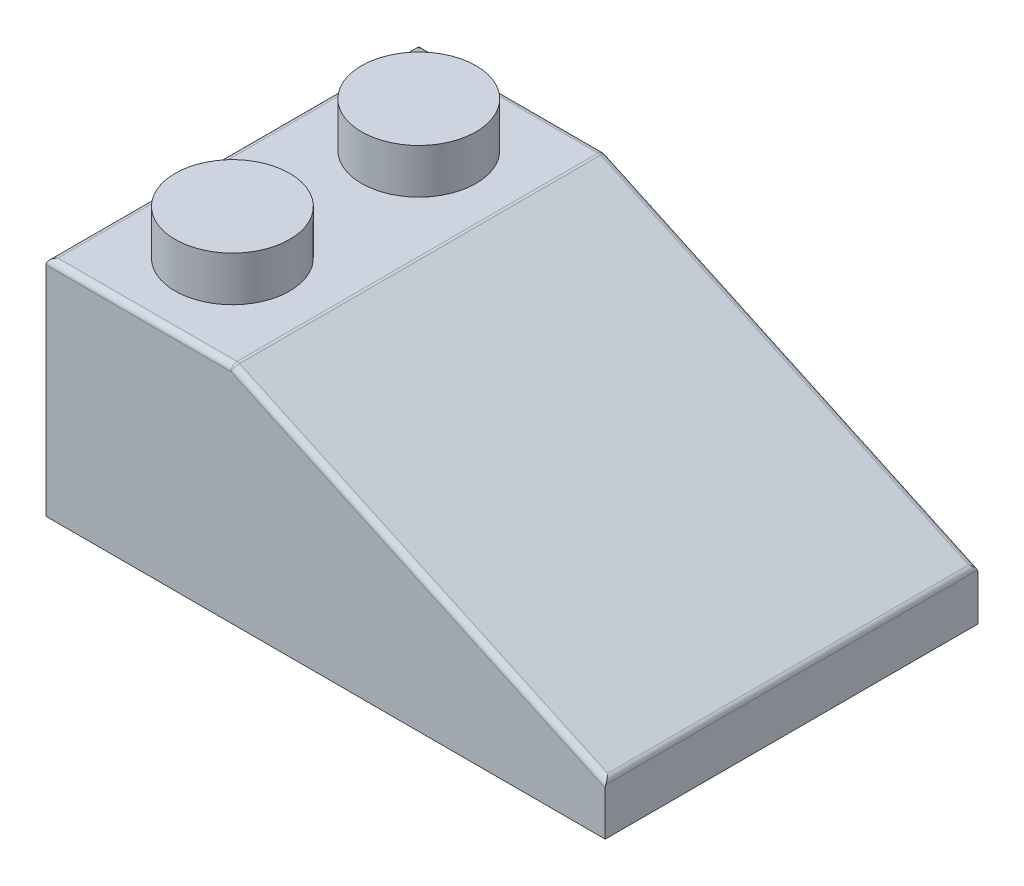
ISO-10303-21;
HEADER;
FILE_DESCRIPTION(('STEP AP214'),'2;1');
FILE_NAME('part.step','',(''),(''),'','','');
FILE_SCHEMA(('AUTOMOTIVE_DESIGN { 1 0 10303 214 1 1 1 1 }'));
ENDSEC;
DATA;
#1=APPLICATION_CONTEXT('core data for automotive mechanical design processes');
#2=APPLICATION_PROTOCOL_DEFINITION('international standard','automotive_design',2000,#1);
#3=PRODUCT_CONTEXT('',#1,'mechanical');
#4=PRODUCT('Part','Part','',(#3));
#5=PRODUCT_RELATED_PRODUCT_CATEGORY('part','',(#4));
#6=PRODUCT_DEFINITION_FORMATION('','',#4);
#7=PRODUCT_DEFINITION_CONTEXT('part definition',#1,'design');
#8=PRODUCT_DEFINITION('design','',#6,#7);
#9=PRODUCT_DEFINITION_SHAPE('','',#8);
#10=(LENGTH_UNIT() NAMED_UNIT(*) SI_UNIT(.MILLI.,.METRE.));
#11=(NAMED_UNIT(*) PLANE_ANGLE_UNIT() SI_UNIT($,.RADIAN.));
#12=(NAMED_UNIT(*) SI_UNIT($,.STERADIAN.) SOLID_ANGLE_UNIT());
#13=UNCERTAINTY_MEASURE_WITH_UNIT(LENGTH_MEASURE(1.E-05),#10,'distance_accuracy_value','');
#14=(GEOMETRIC_REPRESENTATION_CONTEXT(3) GLOBAL_UNCERTAINTY_ASSIGNED_CONTEXT((#13)) GLOBAL_UNIT_ASSIGNED_CONTEXT((#10,
#11,#12)) REPRESENTATION_CONTEXT('',''));
#15=CARTESIAN_POINT('',(0.,0.,0.));
#16=DIRECTION('',(0.,0.,1.));
#17=DIRECTION('',(1.,0.,0.));
#18=AXIS2_PLACEMENT_3D('',#15,#16,#17);
#19=CARTESIAN_POINT('',(-11.90625,0.,7.9375));
#20=DIRECTION('',(0.,-1.,0.));
#21=DIRECTION('',(0.,0.,-1.));
#22=AXIS2_PLACEMENT_3D('',#19,#20,#21);
#23=PLANE('',#22);
#24=DIRECTION('',(0.,0.,1.));
#25=VECTOR('',#24,1.);
#26=CARTESIAN_POINT('',(-11.90625,0.,-7.9375));
#27=LINE('',#26,#25);
#28=CARTESIAN_POINT('',(-11.90625,0.,-7.9375));
#29=VERTEX_POINT('',#28);
#30=CARTESIAN_POINT('',(-11.90625,0.,7.9375));
#31=VERTEX_POINT('',#30);
#32=EDGE_CURVE('E223',#29,#31,#27,.T.);
#33=ORIENTED_EDGE('',*,*,#32,.F.);
#34=DIRECTION('',(1.,0.,0.));
#35=VECTOR('',#34,1.);
#36=CARTESIAN_POINT('',(-11.90625,0.,-7.9375));
#37=LINE('',#36,#35);
#38=CARTESIAN_POINT('',(11.90625,0.,-7.9375));
#39=VERTEX_POINT('',#38);
#40=EDGE_CURVE('E232',#29,#39,#37,.T.);
#41=ORIENTED_EDGE('',*,*,#40,.T.);
#42=DIRECTION('',(0.,0.,-1.));
#43=VECTOR('',#42,1.);
#44=CARTESIAN_POINT('',(11.90625,0.,7.9375));
#45=LINE('',#44,#43);
#46=CARTESIAN_POINT('',(11.90625,0.,7.9375));
#47=VERTEX_POINT('',#46);
#48=EDGE_CURVE('E229',#47,#39,#45,.T.);
#49=ORIENTED_EDGE('',*,*,#48,.F.);
#50=DIRECTION('',(-1.,0.,0.));
#51=VECTOR('',#50,1.);
#52=CARTESIAN_POINT('',(11.90625,0.,7.9375));
#53=LINE('',#52,#51);
#54=EDGE_CURVE('E226',#47,#31,#53,.T.);
#55=ORIENTED_EDGE('',*,*,#54,.T.);
#56=EDGE_LOOP('',(#33,#41,#49,#55));
#57=FACE_BOUND('',#56,.T.);
#58=DIRECTION('',(1.,0.,0.));
#59=VECTOR('',#58,1.);
#60=CARTESIAN_POINT('',(-11.90625,0.,-6.35));
#61=LINE('',#60,#59);
#62=CARTESIAN_POINT('',(-10.31875,0.,-6.35));
#63=VERTEX_POINT('',#62);
#64=CARTESIAN_POINT('',(10.31875,0.,-6.35));
#65=VERTEX_POINT('',#64);
#66=EDGE_CURVE('E185',#63,#65,#61,.T.);
#67=ORIENTED_EDGE('',*,*,#66,.F.);
#68=DIRECTION('',(0.,0.,1.));
#69=VECTOR('',#68,1.);
#70=CARTESIAN_POINT('',(-10.31875,0.,7.9375));
#71=LINE('',#70,#69);
#72=CARTESIAN_POINT('',(-10.31875,0.,6.35));
#73=VERTEX_POINT('',#72);
#74=EDGE_CURVE('E207',#63,#73,#71,.T.);
#75=ORIENTED_EDGE('',*,*,#74,.T.);
#76=DIRECTION('',(-1.,0.,0.));
#77=VECTOR('',#76,1.);
#78=CARTESIAN_POINT('',(-11.90625,0.,6.35));
#79=LINE('',#78,#77);
#80=CARTESIAN_POINT('',(10.31875,0.,6.35));
#81=VERTEX_POINT('',#80);
#82=EDGE_CURVE('E213',#81,#73,#79,.T.);
#83=ORIENTED_EDGE('',*,*,#82,.F.);
#84=DIRECTION('',(0.,0.,-1.));
#85=VECTOR('',#84,1.);
#86=CARTESIAN_POINT('',(10.31875,0.,7.9375));
#87=LINE('',#86,#85);
#88=EDGE_CURVE('E216',#81,#65,#87,.T.);
#89=ORIENTED_EDGE('',*,*,#88,.T.);
#90=EDGE_LOOP('',(#67,#75,#83,#89));
#91=FACE_BOUND('',#90,.T.);
#92=ADVANCED_FACE('F38',(#57,#91),#23,.T.);
#93=CARTESIAN_POINT('',(-11.90625,9.525,7.9375));
#94=DIRECTION('',(0.,-1.,0.));
#95=DIRECTION('',(0.,0.,-1.));
#96=AXIS2_PLACEMENT_3D('',#93,#94,#95);
#97=PLANE('',#96);
#98=DIRECTION('',(1.,0.,0.));
#99=VECTOR('',#98,1.);
#100=CARTESIAN_POINT('',(-11.90625,9.525,-7.6835));
#101=LINE('',#100,#99);
#102=CARTESIAN_POINT('',(-4.02480771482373,9.525,-7.6835));
#103=VERTEX_POINT('',#102);
#104=CARTESIAN_POINT('',(-11.65225,9.525,-7.6835));
#105=VERTEX_POINT('',#104);
#106=EDGE_CURVE('E259',#103,#105,#101,.F.);
#107=ORIENTED_EDGE('',*,*,#106,.T.);
#108=DIRECTION('',(0.,0.,1.));
#109=VECTOR('',#108,1.);
#110=CARTESIAN_POINT('',(-11.65225,9.525,7.9375));
#111=LINE('',#110,#109);
#112=CARTESIAN_POINT('',(-11.65225,9.525,7.6835));
#113=VERTEX_POINT('',#112);
#114=EDGE_CURVE('E261',#105,#113,#111,.T.);
#115=ORIENTED_EDGE('',*,*,#114,.T.);
#116=DIRECTION('',(-1.,0.,0.));
#117=VECTOR('',#116,1.);
#118=CARTESIAN_POINT('',(-3.96875,9.525,7.6835));
#119=LINE('',#118,#117);
#120=CARTESIAN_POINT('',(-4.02480771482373,9.525,7.6835));
#121=VERTEX_POINT('',#120);
#122=EDGE_CURVE('E257',#113,#121,#119,.F.);
#123=ORIENTED_EDGE('',*,*,#122,.T.);
#124=DIRECTION('',(0.,0.,1.));
#125=VECTOR('',#124,1.);
#126=CARTESIAN_POINT('',(-4.02480771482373,9.525,7.9375));
#127=LINE('',#126,#125);
#128=EDGE_CURVE('E255',#121,#103,#127,.F.);
#129=ORIENTED_EDGE('',*,*,#128,.T.);
#130=EDGE_LOOP('',(#107,#115,#123,#129));
#131=FACE_BOUND('',#130,.T.);
#132=CARTESIAN_POINT('',(-7.9375,9.525,3.96875));
#133=DIRECTION('',(0.,-1.,0.));
#134=DIRECTION('',(0.,0.,-1.));
#135=AXIS2_PLACEMENT_3D('',#132,#133,#134);
#136=CIRCLE('',#135,2.4384);
#137=CARTESIAN_POINT('',(-7.9375,9.525,1.53035));
#138=VERTEX_POINT('',#137);
#139=EDGE_CURVE('E243',#138,#138,#136,.F.);
#140=ORIENTED_EDGE('',*,*,#139,.F.);
#141=EDGE_LOOP('',(#140));
#142=FACE_BOUND('',#141,.T.);
#143=CARTESIAN_POINT('',(-7.9375,9.525,-3.96875));
#144=DIRECTION('',(0.,-1.,0.));
#145=DIRECTION('',(0.,0.,-1.));
#146=AXIS2_PLACEMENT_3D('',#143,#144,#145);
#147=CIRCLE('',#146,2.4384);
#148=CARTESIAN_POINT('',(-7.9375,9.525,-6.40715));
#149=VERTEX_POINT('',#148);
#150=EDGE_CURVE('E246',#149,#149,#147,.F.);
#151=ORIENTED_EDGE('',*,*,#150,.F.);
#152=EDGE_LOOP('',(#151));
#153=FACE_BOUND('',#152,.T.);
#154=ADVANCED_FACE('F399',(#131,#142,#153),#97,.F.);
#155=CARTESIAN_POINT('',(-11.90625,9.525,-7.9375));
#156=DIRECTION('',(1.,0.,0.));
#157=DIRECTION('',(0.,0.,-1.));
#158=AXIS2_PLACEMENT_3D('',#155,#156,#157);
#159=PLANE('',#158);
#160=DIRECTION('',(0.,-1.,0.));
#161=VECTOR('',#160,1.);
#162=CARTESIAN_POINT('',(-11.90625,9.525,7.9375));
#163=LINE('',#162,#161);
#164=CARTESIAN_POINT('',(-11.90625,9.271,7.9375));
#165=VERTEX_POINT('',#164);
#166=EDGE_CURVE('E241',#165,#31,#163,.T.);
#167=ORIENTED_EDGE('',*,*,#166,.F.);
#168=DIRECTION('',(0.,0.,1.));
#169=VECTOR('',#168,1.);
#170=CARTESIAN_POINT('',(-11.90625,9.271,-7.9375));
#171=LINE('',#170,#169);
#172=CARTESIAN_POINT('',(-11.90625,9.271,-7.9375));
#173=VERTEX_POINT('',#172);
#174=EDGE_CURVE('E264',#165,#173,#171,.F.);
#175=ORIENTED_EDGE('',*,*,#174,.T.);
#176=DIRECTION('',(0.,-1.,0.));
#177=VECTOR('',#176,1.);
#178=CARTESIAN_POINT('',(-11.90625,9.525,-7.9375));
#179=LINE('',#178,#177);
#180=EDGE_CURVE('E235',#173,#29,#179,.T.);
#181=ORIENTED_EDGE('',*,*,#180,.T.);
#182=ORIENTED_EDGE('',*,*,#32,.T.);
#183=EDGE_LOOP('',(#167,#175,#181,#182));
#184=FACE_BOUND('',#183,.T.);
#185=ADVANCED_FACE('F320',(#184),#159,.F.);
#186=CARTESIAN_POINT('',(11.90625,9.525,7.9375));
#187=DIRECTION('',(0.,0.,1.));
#188=DIRECTION('',(1.,0.,0.));
#189=AXIS2_PLACEMENT_3D('',#186,#187,#188);
#190=PLANE('',#189);
#191=DIRECTION('',(0.907107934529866,-0.420898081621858,0.));
#192=VECTOR('',#191,1.);
#193=CARTESIAN_POINT('',(-4.07565811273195,9.29459458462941,7.9375));
#194=LINE('',#193,#192);
#195=CARTESIAN_POINT('',(11.90625,1.87898922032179,7.9375));
#196=VERTEX_POINT('',#195);
#197=CARTESIAN_POINT('',(-4.02480771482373,9.271,7.9375));
#198=VERTEX_POINT('',#197);
#199=EDGE_CURVE('E271',#196,#198,#194,.F.);
#200=ORIENTED_EDGE('',*,*,#199,.T.);
#201=DIRECTION('',(-1.,0.,0.));
#202=VECTOR('',#201,1.);
#203=CARTESIAN_POINT('',(-11.90625,9.271,7.9375));
#204=LINE('',#203,#202);
#205=EDGE_CURVE('E273',#198,#165,#204,.T.);
#206=ORIENTED_EDGE('',*,*,#205,.T.);
#207=ORIENTED_EDGE('',*,*,#166,.T.);
#208=ORIENTED_EDGE('',*,*,#54,.F.);
#209=DIRECTION('',(0.,-1.,0.));
#210=VECTOR('',#209,1.);
#211=CARTESIAN_POINT('',(11.90625,9.525,7.9375));
#212=LINE('',#211,#210);
#213=EDGE_CURVE('E239',#196,#47,#212,.T.);
#214=ORIENTED_EDGE('',*,*,#213,.F.);
#215=EDGE_LOOP('',(#200,#206,#207,#208,#214));
#216=FACE_BOUND('',#215,.T.);
#217=ADVANCED_FACE('F294',(#216),#190,.T.);
#218=CARTESIAN_POINT('',(11.90625,9.525,7.9375));
#219=DIRECTION('',(-1.,0.,0.));
#220=DIRECTION('',(0.,0.,1.));
#221=AXIS2_PLACEMENT_3D('',#218,#219,#220);
#222=PLANE('',#221);
#223=DIRECTION('',(0.,-1.,0.));
#224=VECTOR('',#223,1.);
#225=CARTESIAN_POINT('',(11.90625,9.525,-7.9375));
#226=LINE('',#225,#224);
#227=CARTESIAN_POINT('',(11.90625,1.87898922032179,-7.9375));
#228=VERTEX_POINT('',#227);
#229=EDGE_CURVE('E237',#228,#39,#226,.T.);
#230=ORIENTED_EDGE('',*,*,#229,.F.);
#231=CARTESIAN_POINT('',(11.90625,1.87898922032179,-7.6835));
#232=DIRECTION('',(-1.,0.,0.));
#233=DIRECTION('',(0.,1.,0.));
#234=AXIS2_PLACEMENT_3D('',#231,#232,#233);
#235=ELLIPSE('',#234,0.280010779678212,0.254);
#236=CARTESIAN_POINT('',(11.90625,1.99684522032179,-7.91390541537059));
#237=VERTEX_POINT('',#236);
#238=EDGE_CURVE('E11',#228,#237,#235,.F.);
#239=ORIENTED_EDGE('',*,*,#238,.T.);
#240=DIRECTION('',(0.,0.,1.));
#241=VECTOR('',#240,1.);
#242=CARTESIAN_POINT('',(11.90625,1.99684522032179,7.9375));
#243=LINE('',#242,#241);
#244=CARTESIAN_POINT('',(11.90625,1.99684522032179,7.91390541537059));
#245=VERTEX_POINT('',#244);
#246=EDGE_CURVE('E46',#237,#245,#243,.T.);
#247=ORIENTED_EDGE('',*,*,#246,.T.);
#248=CARTESIAN_POINT('',(11.90625,1.87898922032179,7.6835));
#249=DIRECTION('',(-1.,0.,0.));
#250=DIRECTION('',(0.,1.,0.));
#251=AXIS2_PLACEMENT_3D('',#248,#249,#250);
#252=ELLIPSE('',#251,0.280010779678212,0.254);
#253=EDGE_CURVE('E284',#245,#196,#252,.F.);
#254=ORIENTED_EDGE('',*,*,#253,.T.);
#255=ORIENTED_EDGE('',*,*,#213,.T.);
#256=ORIENTED_EDGE('',*,*,#48,.T.);
#257=EDGE_LOOP('',(#230,#239,#247,#254,#255,#256));
#258=FACE_BOUND('',#257,.T.);
#259=ADVANCED_FACE('F287',(#258),#222,.F.);
#260=CARTESIAN_POINT('',(-11.90625,9.525,-7.9375));
#261=DIRECTION('',(0.,0.,-1.));
#262=DIRECTION('',(-1.,0.,0.));
#263=AXIS2_PLACEMENT_3D('',#260,#261,#262);
#264=PLANE('',#263);
#265=ORIENTED_EDGE('',*,*,#180,.F.);
#266=DIRECTION('',(1.,0.,0.));
#267=VECTOR('',#266,1.);
#268=CARTESIAN_POINT('',(-3.96875,9.271,-7.9375));
#269=LINE('',#268,#267);
#270=CARTESIAN_POINT('',(-4.02480771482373,9.271,-7.9375));
#271=VERTEX_POINT('',#270);
#272=EDGE_CURVE('E269',#173,#271,#269,.T.);
#273=ORIENTED_EDGE('',*,*,#272,.T.);
#274=DIRECTION('',(0.907107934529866,-0.420898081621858,0.));
#275=VECTOR('',#274,1.);
#276=CARTESIAN_POINT('',(11.7993418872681,1.92859458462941,-7.9375));
#277=LINE('',#276,#275);
#278=EDGE_CURVE('E267',#271,#228,#277,.T.);
#279=ORIENTED_EDGE('',*,*,#278,.T.);
#280=ORIENTED_EDGE('',*,*,#229,.T.);
#281=ORIENTED_EDGE('',*,*,#40,.F.);
#282=EDGE_LOOP('',(#265,#273,#279,#280,#281));
#283=FACE_BOUND('',#282,.T.);
#284=ADVANCED_FACE('F336',(#283),#264,.T.);
#285=CARTESIAN_POINT('',(-7.9375,11.43,3.96875));
#286=DIRECTION('',(0.,-1.,0.));
#287=DIRECTION('',(0.,0.,-1.));
#288=AXIS2_PLACEMENT_3D('',#285,#286,#287);
#289=CYLINDRICAL_SURFACE('',#288,2.4384);
#290=CARTESIAN_POINT('',(-7.9375,11.43,3.96875));
#291=DIRECTION('',(0.,1.,0.));
#292=DIRECTION('',(0.,0.,1.));
#293=AXIS2_PLACEMENT_3D('',#290,#291,#292);
#294=CIRCLE('',#293,2.4384);
#295=CARTESIAN_POINT('',(-7.9375,11.43,1.53035));
#296=VERTEX_POINT('',#295);
#297=EDGE_CURVE('E210',#296,#296,#294,.T.);
#298=CARTESIAN_POINT('',(-7.9375,11.43,1.53035));
#299=CARTESIAN_POINT('',(-7.9375,11.41015625,1.53035));
#300=CARTESIAN_POINT('',(-7.9375,11.3903125,1.53035));
#301=CARTESIAN_POINT('',(-7.9375,11.350625,1.53035));
#302=CARTESIAN_POINT('',(-7.9375,11.33078125,1.53035));
#303=CARTESIAN_POINT('',(-7.9375,11.29109375,1.53035));
#304=CARTESIAN_POINT('',(-7.9375,11.27125,1.53035));
#305=CARTESIAN_POINT('',(-7.9375,11.2315625,1.53035));
#306=CARTESIAN_POINT('',(-7.9375,11.21171875,1.53035));
#307=CARTESIAN_POINT('',(-7.9375,11.17203125,1.53035));
#308=CARTESIAN_POINT('',(-7.9375,11.1521875,1.53035));
#309=CARTESIAN_POINT('',(-7.9375,11.1125,1.53035));
#310=CARTESIAN_POINT('',(-7.9375,11.09265625,1.53035));
#311=CARTESIAN_POINT('',(-7.9375,11.05296875,1.53035));
#312=CARTESIAN_POINT('',(-7.9375,11.033125,1.53035));
#313=CARTESIAN_POINT('',(-7.9375,10.9934375,1.53035));
#314=CARTESIAN_POINT('',(-7.9375,10.97359375,1.53035));
#315=CARTESIAN_POINT('',(-7.9375,10.93390625,1.53035));
#316=CARTESIAN_POINT('',(-7.9375,10.9140625,1.53035));
#317=CARTESIAN_POINT('',(-7.9375,10.874375,1.53035));
#318=CARTESIAN_POINT('',(-7.9375,10.85453125,1.53035));
#319=CARTESIAN_POINT('',(-7.9375,10.81484375,1.53035));
#320=CARTESIAN_POINT('',(-7.9375,10.795,1.53035));
#321=CARTESIAN_POINT('',(-7.9375,10.7553125,1.53035));
#322=CARTESIAN_POINT('',(-7.9375,10.73546875,1.53035));
#323=CARTESIAN_POINT('',(-7.9375,10.69578125,1.53035));
#324=CARTESIAN_POINT('',(-7.9375,10.6759375,1.53035));
#325=CARTESIAN_POINT('',(-7.9375,10.63625,1.53035));
#326=CARTESIAN_POINT('',(-7.9375,10.61640625,1.53035));
#327=CARTESIAN_POINT('',(-7.9375,10.57671875,1.53035));
#328=CARTESIAN_POINT('',(-7.9375,10.556875,1.53035));
#329=CARTESIAN_POINT('',(-7.9375,10.5171875,1.53035));
#330=CARTESIAN_POINT('',(-7.9375,10.49734375,1.53035));
#331=CARTESIAN_POINT('',(-7.9375,10.45765625,1.53035));
#332=CARTESIAN_POINT('',(-7.9375,10.4378125,1.53035));
#333=CARTESIAN_POINT('',(-7.9375,10.398125,1.53035));
#334=CARTESIAN_POINT('',(-7.9375,10.37828125,1.53035));
#335=CARTESIAN_POINT('',(-7.9375,10.33859375,1.53035));
#336=CARTESIAN_POINT('',(-7.9375,10.31875,1.53035));
#337=CARTESIAN_POINT('',(-7.9375,10.2790625,1.53035));
#338=CARTESIAN_POINT('',(-7.9375,10.25921875,1.53035));
#339=CARTESIAN_POINT('',(-7.9375,10.21953125,1.53035));
#340=CARTESIAN_POINT('',(-7.9375,10.1996875,1.53035));
#341=CARTESIAN_POINT('',(-7.9375,10.16,1.53035));
#342=CARTESIAN_POINT('',(-7.9375,10.14015625,1.53035));
#343=CARTESIAN_POINT('',(-7.9375,10.10046875,1.53035));
#344=CARTESIAN_POINT('',(-7.9375,10.080625,1.53035));
#345=CARTESIAN_POINT('',(-7.9375,10.0409375,1.53035));
#346=CARTESIAN_POINT('',(-7.9375,10.02109375,1.53035));
#347=CARTESIAN_POINT('',(-7.9375,9.98140625,1.53035));
#348=CARTESIAN_POINT('',(-7.9375,9.9615625,1.53035));
#349=CARTESIAN_POINT('',(-7.9375,9.921875,1.53035));
#350=CARTESIAN_POINT('',(-7.9375,9.90203125,1.53035));
#351=CARTESIAN_POINT('',(-7.9375,9.86234375,1.53035));
#352=CARTESIAN_POINT('',(-7.9375,9.8425,1.53035));
#353=CARTESIAN_POINT('',(-7.9375,9.8028125,1.53035));
#354=CARTESIAN_POINT('',(-7.9375,9.78296875,1.53035));
#355=CARTESIAN_POINT('',(-7.9375,9.74328125,1.53035));
#356=CARTESIAN_POINT('',(-7.9375,9.7234375,1.53035));
#357=CARTESIAN_POINT('',(-7.9375,9.68375,1.53035));
#358=CARTESIAN_POINT('',(-7.9375,9.66390625,1.53035));
#359=CARTESIAN_POINT('',(-7.9375,9.62421875,1.53035));
#360=CARTESIAN_POINT('',(-7.9375,9.604375,1.53035));
#361=CARTESIAN_POINT('',(-7.9375,9.5646875,1.53035));
#362=CARTESIAN_POINT('',(-7.9375,9.54484375,1.53035));
#363=CARTESIAN_POINT('',(-7.9375,9.525,1.53035));
#364=B_SPLINE_CURVE_WITH_KNOTS('',3,(#298,#299,#300,#301,#302,#303,#304,#305,#306,#307,#308,
#309,#310,#311,#312,#313,#314,#315,#316,#317,#318,#319,#320,#321,#322,#323,#324,#325,#326,#327,
#328,#329,#330,#331,#332,#333,#334,#335,#336,#337,#338,#339,#340,#341,#342,#343,#344,#345,#346,
#347,#348,#349,#350,#351,#352,#353,#354,#355,#356,#357,#358,#359,#360,#361,#362,#363),
.UNSPECIFIED.,.F.,.F.,(4,2,2,2,2,2,2,2,2,2,2,2,2,2,2,2,2,2,2,2,2,2,2,2,2,2,2,2,2,2,2,2,4),(0.,
0.0595312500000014,0.119062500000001,0.178593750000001,0.238125,0.29765625,0.3571875,
0.416718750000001,0.476250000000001,0.535781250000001,0.5953125,0.65484375,0.714375,
0.773906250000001,0.833437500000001,0.892968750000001,0.9525,1.01203125,1.0715625,1.13109375,
1.190625,1.25015625,1.3096875,1.36921875,1.42875,1.48828125,1.5478125,1.60734375,1.666875,
1.72640625,1.7859375,1.84546875,1.905),.UNSPECIFIED.);
#365=EDGE_CURVE('BSEAM409',#296,#138,#364,.T.);
#366=ORIENTED_EDGE('',*,*,#297,.F.);
#367=ORIENTED_EDGE('',*,*,#139,.T.);
#368=ORIENTED_EDGE('',*,*,#365,.T.);
#369=ORIENTED_EDGE('',*,*,#365,.F.);
#370=EDGE_LOOP('',(#366,#368,#367,#369));
#371=FACE_BOUND('',#370,.T.);
#372=ADVANCED_FACE('F409',(#371),#289,.T.);
#373=CARTESIAN_POINT('',(-7.9375,11.43,3.96875));
#374=DIRECTION('',(0.,1.,0.));
#375=DIRECTION('',(0.,0.,1.));
#376=AXIS2_PLACEMENT_3D('',#373,#374,#375);
#377=PLANE('',#376);
#378=ORIENTED_EDGE('',*,*,#297,.T.);
#379=EDGE_LOOP('',(#378));
#380=FACE_BOUND('',#379,.T.);
#381=ADVANCED_FACE('F429',(#380),#377,.T.);
#382=CARTESIAN_POINT('',(-7.9375,11.43,-3.96875));
#383=DIRECTION('',(0.,1.,0.));
#384=DIRECTION('',(0.,0.,1.));
#385=AXIS2_PLACEMENT_3D('',#382,#383,#384);
#386=PLANE('',#385);
#387=CARTESIAN_POINT('',(-7.9375,11.43,-3.96875));
#388=DIRECTION('',(0.,1.,0.));
#389=DIRECTION('',(0.,0.,1.));
#390=AXIS2_PLACEMENT_3D('',#387,#388,#389);
#391=CIRCLE('',#390,2.4384);
#392=CARTESIAN_POINT('',(-7.9375,11.43,-6.40715));
#393=VERTEX_POINT('',#392);
#394=EDGE_CURVE('E249',#393,#393,#391,.T.);
#395=ORIENTED_EDGE('',*,*,#394,.T.);
#396=EDGE_LOOP('',(#395));
#397=FACE_BOUND('',#396,.T.);
#398=ADVANCED_FACE('F40',(#397),#386,.T.);
#399=CARTESIAN_POINT('',(-7.9375,11.43,-3.96875));
#400=DIRECTION('',(0.,-1.,0.));
#401=DIRECTION('',(0.,0.,-1.));
#402=AXIS2_PLACEMENT_3D('',#399,#400,#401);
#403=CYLINDRICAL_SURFACE('',#402,2.4384);
#404=CARTESIAN_POINT('',(-7.9375,11.43,-6.40715));
#405=CARTESIAN_POINT('',(-7.9375,11.41015625,-6.40715));
#406=CARTESIAN_POINT('',(-7.9375,11.3903125,-6.40715));
#407=CARTESIAN_POINT('',(-7.9375,11.350625,-6.40715));
#408=CARTESIAN_POINT('',(-7.9375,11.33078125,-6.40715));
#409=CARTESIAN_POINT('',(-7.9375,11.29109375,-6.40715));
#410=CARTESIAN_POINT('',(-7.9375,11.27125,-6.40715));
#411=CARTESIAN_POINT('',(-7.9375,11.2315625,-6.40715));
#412=CARTESIAN_POINT('',(-7.9375,11.21171875,-6.40715));
#413=CARTESIAN_POINT('',(-7.9375,11.17203125,-6.40715));
#414=CARTESIAN_POINT('',(-7.9375,11.1521875,-6.40715));
#415=CARTESIAN_POINT('',(-7.9375,11.1125,-6.40715));
#416=CARTESIAN_POINT('',(-7.9375,11.09265625,-6.40715));
#417=CARTESIAN_POINT('',(-7.9375,11.05296875,-6.40715));
#418=CARTESIAN_POINT('',(-7.9375,11.033125,-6.40715));
#419=CARTESIAN_POINT('',(-7.9375,10.9934375,-6.40715));
#420=CARTESIAN_POINT('',(-7.9375,10.97359375,-6.40715));
#421=CARTESIAN_POINT('',(-7.9375,10.93390625,-6.40715));
#422=CARTESIAN_POINT('',(-7.9375,10.9140625,-6.40715));
#423=CARTESIAN_POINT('',(-7.9375,10.874375,-6.40715));
#424=CARTESIAN_POINT('',(-7.9375,10.85453125,-6.40715));
#425=CARTESIAN_POINT('',(-7.9375,10.81484375,-6.40715));
#426=CARTESIAN_POINT('',(-7.9375,10.795,-6.40715));
#427=CARTESIAN_POINT('',(-7.9375,10.7553125,-6.40715));
#428=CARTESIAN_POINT('',(-7.9375,10.73546875,-6.40715));
#429=CARTESIAN_POINT('',(-7.9375,10.69578125,-6.40715));
#430=CARTESIAN_POINT('',(-7.9375,10.6759375,-6.40715));
#431=CARTESIAN_POINT('',(-7.9375,10.63625,-6.40715));
#432=CARTESIAN_POINT('',(-7.9375,10.61640625,-6.40715));
#433=CARTESIAN_POINT('',(-7.9375,10.57671875,-6.40715));
#434=CARTESIAN_POINT('',(-7.9375,10.556875,-6.40715));
#435=CARTESIAN_POINT('',(-7.9375,10.5171875,-6.40715));
#436=CARTESIAN_POINT('',(-7.9375,10.49734375,-6.40715));
#437=CARTESIAN_POINT('',(-7.9375,10.45765625,-6.40715));
#438=CARTESIAN_POINT('',(-7.9375,10.4378125,-6.40715));
#439=CARTESIAN_POINT('',(-7.9375,10.398125,-6.40715));
#440=CARTESIAN_POINT('',(-7.9375,10.37828125,-6.40715));
#441=CARTESIAN_POINT('',(-7.9375,10.33859375,-6.40715));
#442=CARTESIAN_POINT('',(-7.9375,10.31875,-6.40715));
#443=CARTESIAN_POINT('',(-7.9375,10.2790625,-6.40715));
#444=CARTESIAN_POINT('',(-7.9375,10.25921875,-6.40715));
#445=CARTESIAN_POINT('',(-7.9375,10.21953125,-6.40715));
#446=CARTESIAN_POINT('',(-7.9375,10.1996875,-6.40715));
#447=CARTESIAN_POINT('',(-7.9375,10.16,-6.40715));
#448=CARTESIAN_POINT('',(-7.9375,10.14015625,-6.40715));
#449=CARTESIAN_POINT('',(-7.9375,10.10046875,-6.40715));
#450=CARTESIAN_POINT('',(-7.9375,10.080625,-6.40715));
#451=CARTESIAN_POINT('',(-7.9375,10.0409375,-6.40715));
#452=CARTESIAN_POINT('',(-7.9375,10.02109375,-6.40715));
#453=CARTESIAN_POINT('',(-7.9375,9.98140625,-6.40715));
#454=CARTESIAN_POINT('',(-7.9375,9.9615625,-6.40715));
#455=CARTESIAN_POINT('',(-7.9375,9.921875,-6.40715));
#456=CARTESIAN_POINT('',(-7.9375,9.90203125,-6.40715));
#457=CARTESIAN_POINT('',(-7.9375,9.86234375,-6.40715));
#458=CARTESIAN_POINT('',(-7.9375,9.8425,-6.40715));
#459=CARTESIAN_POINT('',(-7.9375,9.8028125,-6.40715));
#460=CARTESIAN_POINT('',(-7.9375,9.78296875,-6.40715));
#461=CARTESIAN_POINT('',(-7.9375,9.74328125,-6.40715));
#462=CARTESIAN_POINT('',(-7.9375,9.7234375,-6.40715));
#463=CARTESIAN_POINT('',(-7.9375,9.68375,-6.40715));
#464=CARTESIAN_POINT('',(-7.9375,9.66390625,-6.40715));
#465=CARTESIAN_POINT('',(-7.9375,9.62421875,-6.40715));
#466=CARTESIAN_POINT('',(-7.9375,9.604375,-6.40715));
#467=CARTESIAN_POINT('',(-7.9375,9.5646875,-6.40715));
#468=CARTESIAN_POINT('',(-7.9375,9.54484375,-6.40715));
#469=CARTESIAN_POINT('',(-7.9375,9.525,-6.40715));
#470=B_SPLINE_CURVE_WITH_KNOTS('',3,(#404,#405,#406,#407,#408,#409,#410,#411,#412,#413,#414,
#415,#416,#417,#418,#419,#420,#421,#422,#423,#424,#425,#426,#427,#428,#429,#430,#431,#432,#433,
#434,#435,#436,#437,#438,#439,#440,#441,#442,#443,#444,#445,#446,#447,#448,#449,#450,#451,#452,
#453,#454,#455,#456,#457,#458,#459,#460,#461,#462,#463,#464,#465,#466,#467,#468,#469),
.UNSPECIFIED.,.F.,.F.,(4,2,2,2,2,2,2,2,2,2,2,2,2,2,2,2,2,2,2,2,2,2,2,2,2,2,2,2,2,2,2,2,4),(0.,
0.0595312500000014,0.119062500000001,0.178593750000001,0.238125,0.29765625,0.3571875,
0.416718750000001,0.476250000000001,0.535781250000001,0.5953125,0.65484375,0.714375,
0.773906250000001,0.833437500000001,0.892968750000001,0.9525,1.01203125,1.0715625,1.13109375,
1.190625,1.25015625,1.3096875,1.36921875,1.42875,1.48828125,1.5478125,1.60734375,1.666875,
1.72640625,1.7859375,1.84546875,1.905),.UNSPECIFIED.);
#471=EDGE_CURVE('BSEAM419',#393,#149,#470,.T.);
#472=ORIENTED_EDGE('',*,*,#394,.F.);
#473=ORIENTED_EDGE('',*,*,#150,.T.);
#474=ORIENTED_EDGE('',*,*,#471,.T.);
#475=ORIENTED_EDGE('',*,*,#471,.F.);
#476=EDGE_LOOP('',(#472,#474,#473,#475));
#477=FACE_BOUND('',#476,.T.);
#478=ADVANCED_FACE('F419',(#477),#403,.T.);
#479=CARTESIAN_POINT('',(-3.96875,9.525,-7.9375));
#480=DIRECTION('',(-0.420898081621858,-0.907107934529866,0.));
#481=DIRECTION('',(0.907107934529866,-0.420898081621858,0.));
#482=AXIS2_PLACEMENT_3D('',#479,#480,#481);
#483=PLANE('',#482);
#484=DIRECTION('',(0.907107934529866,-0.420898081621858,0.));
#485=VECTOR('',#484,1.);
#486=CARTESIAN_POINT('',(-3.96875,9.525,-7.6835));
#487=LINE('',#486,#485);
#488=CARTESIAN_POINT('',(11.759158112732,2.22725063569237,-7.6835));
#489=VERTEX_POINT('',#488);
#490=CARTESIAN_POINT('',(-3.91789960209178,9.50140541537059,-7.6835));
#491=VERTEX_POINT('',#490);
#492=EDGE_CURVE('E279',#489,#491,#487,.F.);
#493=ORIENTED_EDGE('',*,*,#492,.T.);
#494=DIRECTION('',(0.,0.,1.));
#495=VECTOR('',#494,1.);
#496=CARTESIAN_POINT('',(-3.91789960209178,9.50140541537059,-7.9375));
#497=LINE('',#496,#495);
#498=CARTESIAN_POINT('',(-3.91789960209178,9.50140541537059,7.6835));
#499=VERTEX_POINT('',#498);
#500=EDGE_CURVE('E281',#491,#499,#497,.T.);
#501=ORIENTED_EDGE('',*,*,#500,.T.);
#502=DIRECTION('',(0.907107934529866,-0.420898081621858,0.));
#503=VECTOR('',#502,1.);
#504=CARTESIAN_POINT('',(11.90625,2.159,7.6835));
#505=LINE('',#504,#503);
#506=CARTESIAN_POINT('',(11.759158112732,2.22725063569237,7.6835));
#507=VERTEX_POINT('',#506);
#508=EDGE_CURVE('E275',#499,#507,#505,.T.);
#509=ORIENTED_EDGE('',*,*,#508,.T.);
#510=DIRECTION('',(0.,0.,1.));
#511=VECTOR('',#510,1.);
#512=CARTESIAN_POINT('',(11.7591581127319,2.22725063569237,-7.9375));
#513=LINE('',#512,#511);
#514=EDGE_CURVE('E277',#507,#489,#513,.F.);
#515=ORIENTED_EDGE('',*,*,#514,.T.);
#516=EDGE_LOOP('',(#493,#501,#509,#515));
#517=FACE_BOUND('',#516,.T.);
#518=ADVANCED_FACE('F421',(#517),#483,.F.);
#519=CARTESIAN_POINT('',(-11.90625,7.9375,7.9375));
#520=DIRECTION('',(0.,-1.,0.));
#521=DIRECTION('',(0.,0.,-1.));
#522=AXIS2_PLACEMENT_3D('',#519,#520,#521);
#523=PLANE('',#522);
#524=CARTESIAN_POINT('',(-3.96875,7.9375,0.));
#525=DIRECTION('',(0.,-1.,0.));
#526=DIRECTION('',(0.,0.,-1.));
#527=AXIS2_PLACEMENT_3D('',#524,#525,#526);
#528=CIRCLE('',#527,3.2004);
#529=CARTESIAN_POINT('',(-4.31911071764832,7.9375,-3.18116449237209));
#530=VERTEX_POINT('',#529);
#531=CARTESIAN_POINT('',(-4.31911071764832,7.9375,3.18116449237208));
#532=VERTEX_POINT('',#531);
#533=EDGE_CURVE('E369',#530,#532,#528,.F.);
#534=ORIENTED_EDGE('',*,*,#533,.T.);
#535=DIRECTION('',(0.,0.,1.));
#536=VECTOR('',#535,1.);
#537=CARTESIAN_POINT('',(-4.31911071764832,7.9375,-7.9375));
#538=LINE('',#537,#536);
#539=CARTESIAN_POINT('',(-4.31911071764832,7.9375,6.35));
#540=VERTEX_POINT('',#539);
#541=EDGE_CURVE('E169',#532,#540,#538,.T.);
#542=ORIENTED_EDGE('',*,*,#541,.T.);
#543=DIRECTION('',(-1.,0.,0.));
#544=VECTOR('',#543,1.);
#545=CARTESIAN_POINT('',(-11.90625,7.9375,6.35));
#546=LINE('',#545,#544);
#547=CARTESIAN_POINT('',(-10.31875,7.9375,6.35));
#548=VERTEX_POINT('',#547);
#549=EDGE_CURVE('E176',#540,#548,#546,.T.);
#550=ORIENTED_EDGE('',*,*,#549,.T.);
#551=DIRECTION('',(0.,0.,1.));
#552=VECTOR('',#551,1.);
#553=CARTESIAN_POINT('',(-10.31875,7.9375,7.9375));
#554=LINE('',#553,#552);
#555=CARTESIAN_POINT('',(-10.31875,7.9375,-6.35));
#556=VERTEX_POINT('',#555);
#557=EDGE_CURVE('E182',#556,#548,#554,.T.);
#558=ORIENTED_EDGE('',*,*,#557,.F.);
#559=DIRECTION('',(1.,0.,0.));
#560=VECTOR('',#559,1.);
#561=CARTESIAN_POINT('',(-11.90625,7.9375,-6.35));
#562=LINE('',#561,#560);
#563=CARTESIAN_POINT('',(-4.31911071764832,7.9375,-6.35));
#564=VERTEX_POINT('',#563);
#565=EDGE_CURVE('E178',#556,#564,#562,.T.);
#566=ORIENTED_EDGE('',*,*,#565,.T.);
#567=EDGE_CURVE('E168',#564,#530,#538,.T.);
#568=ORIENTED_EDGE('',*,*,#567,.T.);
#569=EDGE_LOOP('',(#534,#542,#550,#558,#566,#568));
#570=FACE_BOUND('',#569,.T.);
#571=CARTESIAN_POINT('',(-7.9375,7.9375,3.96875));
#572=DIRECTION('',(0.,-1.,0.));
#573=DIRECTION('',(0.,0.,-1.));
#574=AXIS2_PLACEMENT_3D('',#571,#572,#573);
#575=CIRCLE('',#574,0.850899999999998);
#576=CARTESIAN_POINT('',(-7.9375,7.9375,3.11785));
#577=VERTEX_POINT('',#576);
#578=EDGE_CURVE('E190',#577,#577,#575,.F.);
#579=ORIENTED_EDGE('',*,*,#578,.T.);
#580=EDGE_LOOP('',(#579));
#581=FACE_BOUND('',#580,.T.);
#582=CARTESIAN_POINT('',(-7.9375,7.9375,-3.96875));
#583=DIRECTION('',(0.,-1.,0.));
#584=DIRECTION('',(0.,0.,-1.));
#585=AXIS2_PLACEMENT_3D('',#582,#583,#584);
#586=CIRCLE('',#585,0.850899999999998);
#587=CARTESIAN_POINT('',(-7.9375,7.9375,-4.81965));
#588=VERTEX_POINT('',#587);
#589=EDGE_CURVE('E186',#588,#588,#586,.F.);
#590=ORIENTED_EDGE('',*,*,#589,.T.);
#591=EDGE_LOOP('',(#590));
#592=FACE_BOUND('',#591,.T.);
#593=ADVANCED_FACE('F379',(#570,#581,#592),#523,.T.);
#594=CARTESIAN_POINT('',(-10.31875,9.525,-7.9375));
#595=DIRECTION('',(1.,0.,0.));
#596=DIRECTION('',(0.,0.,-1.));
#597=AXIS2_PLACEMENT_3D('',#594,#595,#596);
#598=PLANE('',#597);
#599=ORIENTED_EDGE('',*,*,#74,.F.);
#600=DIRECTION('',(0.,-1.,0.));
#601=VECTOR('',#600,1.);
#602=CARTESIAN_POINT('',(-10.31875,9.525,-6.35));
#603=LINE('',#602,#601);
#604=EDGE_CURVE('E181',#556,#63,#603,.T.);
#605=ORIENTED_EDGE('',*,*,#604,.F.);
#606=ORIENTED_EDGE('',*,*,#557,.T.);
#607=DIRECTION('',(0.,-1.,0.));
#608=VECTOR('',#607,1.);
#609=CARTESIAN_POINT('',(-10.31875,9.525,6.35));
#610=LINE('',#609,#608);
#611=EDGE_CURVE('E191',#548,#73,#610,.T.);
#612=ORIENTED_EDGE('',*,*,#611,.T.);
#613=EDGE_LOOP('',(#599,#605,#606,#612));
#614=FACE_BOUND('',#613,.T.);
#615=ADVANCED_FACE('F462',(#614),#598,.T.);
#616=CARTESIAN_POINT('',(11.90625,9.525,6.35));
#617=DIRECTION('',(0.,0.,1.));
#618=DIRECTION('',(1.,0.,0.));
#619=AXIS2_PLACEMENT_3D('',#616,#617,#618);
#620=PLANE('',#619);
#621=DIRECTION('',(0.907107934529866,-0.420898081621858,0.));
#622=VECTOR('',#621,1.);
#623=CARTESIAN_POINT('',(8.42573557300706,2.0238913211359,6.35));
#624=LINE('',#623,#622);
#625=CARTESIAN_POINT('',(10.31875,1.14553262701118,6.35));
#626=VERTEX_POINT('',#625);
#627=EDGE_CURVE('E165',#540,#626,#624,.T.);
#628=ORIENTED_EDGE('',*,*,#627,.T.);
#629=DIRECTION('',(0.,-1.,0.));
#630=VECTOR('',#629,1.);
#631=CARTESIAN_POINT('',(10.31875,9.525,6.35));
#632=LINE('',#631,#630);
#633=EDGE_CURVE('E193',#626,#81,#632,.T.);
#634=ORIENTED_EDGE('',*,*,#633,.T.);
#635=ORIENTED_EDGE('',*,*,#82,.T.);
#636=ORIENTED_EDGE('',*,*,#611,.F.);
#637=ORIENTED_EDGE('',*,*,#549,.F.);
#638=EDGE_LOOP('',(#628,#634,#635,#636,#637));
#639=FACE_BOUND('',#638,.T.);
#640=ADVANCED_FACE('F468',(#639),#620,.F.);
#641=CARTESIAN_POINT('',(10.31875,9.525,7.9375));
#642=DIRECTION('',(-1.,0.,0.));
#643=DIRECTION('',(0.,0.,1.));
#644=AXIS2_PLACEMENT_3D('',#641,#642,#643);
#645=PLANE('',#644);
#646=DIRECTION('',(0.,-1.,0.));
#647=VECTOR('',#646,1.);
#648=CARTESIAN_POINT('',(10.31875,9.525,-6.35));
#649=LINE('',#648,#647);
#650=CARTESIAN_POINT('',(10.31875,1.14553262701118,-6.35));
#651=VERTEX_POINT('',#650);
#652=EDGE_CURVE('E195',#651,#65,#649,.T.);
#653=ORIENTED_EDGE('',*,*,#652,.T.);
#654=ORIENTED_EDGE('',*,*,#88,.F.);
#655=ORIENTED_EDGE('',*,*,#633,.F.);
#656=DIRECTION('',(0.,0.,1.));
#657=VECTOR('',#656,1.);
#658=CARTESIAN_POINT('',(10.31875,1.14553262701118,7.9375));
#659=LINE('',#658,#657);
#660=EDGE_CURVE('E172',#651,#626,#659,.T.);
#661=ORIENTED_EDGE('',*,*,#660,.F.);
#662=EDGE_LOOP('',(#653,#654,#655,#661));
#663=FACE_BOUND('',#662,.T.);
#664=ADVANCED_FACE('F395',(#663),#645,.T.);
#665=CARTESIAN_POINT('',(-11.90625,9.525,-6.35));
#666=DIRECTION('',(0.,0.,-1.));
#667=DIRECTION('',(-1.,0.,0.));
#668=AXIS2_PLACEMENT_3D('',#665,#666,#667);
#669=PLANE('',#668);
#670=DIRECTION('',(0.907107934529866,-0.420898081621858,0.));
#671=VECTOR('',#670,1.);
#672=CARTESIAN_POINT('',(-4.6369257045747,8.08496615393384,-6.35));
#673=LINE('',#672,#671);
#674=EDGE_CURVE('E173',#564,#651,#673,.T.);
#675=ORIENTED_EDGE('',*,*,#674,.F.);
#676=ORIENTED_EDGE('',*,*,#565,.F.);
#677=ORIENTED_EDGE('',*,*,#604,.T.);
#678=ORIENTED_EDGE('',*,*,#66,.T.);
#679=ORIENTED_EDGE('',*,*,#652,.F.);
#680=EDGE_LOOP('',(#675,#676,#677,#678,#679));
#681=FACE_BOUND('',#680,.T.);
#682=ADVANCED_FACE('F385',(#681),#669,.F.);
#683=CARTESIAN_POINT('',(-7.9375,11.43,3.96875));
#684=DIRECTION('',(0.,-1.,0.));
#685=DIRECTION('',(0.,0.,-1.));
#686=AXIS2_PLACEMENT_3D('',#683,#684,#685);
#687=CYLINDRICAL_SURFACE('',#686,0.850899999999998);
#688=CARTESIAN_POINT('',(-7.9375,9.8425,3.96875));
#689=DIRECTION('',(0.,1.,0.));
#690=DIRECTION('',(0.,0.,1.));
#691=AXIS2_PLACEMENT_3D('',#688,#689,#690);
#692=CIRCLE('',#691,0.850899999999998);
#693=CARTESIAN_POINT('',(-7.9375,9.8425,3.11785));
#694=VERTEX_POINT('',#693);
#695=EDGE_CURVE('E202',#694,#694,#692,.T.);
#696=CARTESIAN_POINT('',(-7.9375,9.8425,3.11785));
#697=CARTESIAN_POINT('',(-7.9375,9.82265625,3.11785));
#698=CARTESIAN_POINT('',(-7.9375,9.8028125,3.11785));
#699=CARTESIAN_POINT('',(-7.9375,9.763125,3.11785));
#700=CARTESIAN_POINT('',(-7.9375,9.74328125,3.11785));
#701=CARTESIAN_POINT('',(-7.9375,9.70359375,3.11785));
#702=CARTESIAN_POINT('',(-7.9375,9.68375,3.11785));
#703=CARTESIAN_POINT('',(-7.9375,9.6440625,3.11785));
#704=CARTESIAN_POINT('',(-7.9375,9.62421875,3.11785));
#705=CARTESIAN_POINT('',(-7.9375,9.58453125,3.11785));
#706=CARTESIAN_POINT('',(-7.9375,9.5646875,3.11785));
#707=CARTESIAN_POINT('',(-7.9375,9.525,3.11785));
#708=CARTESIAN_POINT('',(-7.9375,9.50515625,3.11785));
#709=CARTESIAN_POINT('',(-7.9375,9.46546875,3.11785));
#710=CARTESIAN_POINT('',(-7.9375,9.445625,3.11785));
#711=CARTESIAN_POINT('',(-7.9375,9.4059375,3.11785));
#712=CARTESIAN_POINT('',(-7.9375,9.38609375,3.11785));
#713=CARTESIAN_POINT('',(-7.9375,9.34640625,3.11785));
#714=CARTESIAN_POINT('',(-7.9375,9.3265625,3.11785));
#715=CARTESIAN_POINT('',(-7.9375,9.286875,3.11785));
#716=CARTESIAN_POINT('',(-7.9375,9.26703125,3.11785));
#717=CARTESIAN_POINT('',(-7.9375,9.22734375,3.11785));
#718=CARTESIAN_POINT('',(-7.9375,9.2075,3.11785));
#719=CARTESIAN_POINT('',(-7.9375,9.1678125,3.11785));
#720=CARTESIAN_POINT('',(-7.9375,9.14796875,3.11785));
#721=CARTESIAN_POINT('',(-7.9375,9.10828125,3.11785));
#722=CARTESIAN_POINT('',(-7.9375,9.0884375,3.11785));
#723=CARTESIAN_POINT('',(-7.9375,9.04875,3.11785));
#724=CARTESIAN_POINT('',(-7.9375,9.02890625,3.11785));
#725=CARTESIAN_POINT('',(-7.9375,8.98921875,3.11785));
#726=CARTESIAN_POINT('',(-7.9375,8.969375,3.11785));
#727=CARTESIAN_POINT('',(-7.9375,8.9296875,3.11785));
#728=CARTESIAN_POINT('',(-7.9375,8.90984375,3.11785));
#729=CARTESIAN_POINT('',(-7.9375,8.87015625,3.11785));
#730=CARTESIAN_POINT('',(-7.9375,8.8503125,3.11785));
#731=CARTESIAN_POINT('',(-7.9375,8.810625,3.11785));
#732=CARTESIAN_POINT('',(-7.9375,8.79078125,3.11785));
#733=CARTESIAN_POINT('',(-7.9375,8.75109375,3.11785));
#734=CARTESIAN_POINT('',(-7.9375,8.73125,3.11785));
#735=CARTESIAN_POINT('',(-7.9375,8.6915625,3.11785));
#736=CARTESIAN_POINT('',(-7.9375,8.67171875,3.11785));
#737=CARTESIAN_POINT('',(-7.9375,8.63203125,3.11785));
#738=CARTESIAN_POINT('',(-7.9375,8.6121875,3.11785));
#739=CARTESIAN_POINT('',(-7.9375,8.5725,3.11785));
#740=CARTESIAN_POINT('',(-7.9375,8.55265625,3.11785));
#741=CARTESIAN_POINT('',(-7.9375,8.51296875,3.11785));
#742=CARTESIAN_POINT('',(-7.9375,8.493125,3.11785));
#743=CARTESIAN_POINT('',(-7.9375,8.4534375,3.11785));
#744=CARTESIAN_POINT('',(-7.9375,8.43359375,3.11785));
#745=CARTESIAN_POINT('',(-7.9375,8.39390625,3.11785));
#746=CARTESIAN_POINT('',(-7.9375,8.3740625,3.11785));
#747=CARTESIAN_POINT('',(-7.9375,8.334375,3.11785));
#748=CARTESIAN_POINT('',(-7.9375,8.31453125,3.11785));
#749=CARTESIAN_POINT('',(-7.9375,8.27484375,3.11785));
#750=CARTESIAN_POINT('',(-7.9375,8.255,3.11785));
#751=CARTESIAN_POINT('',(-7.9375,8.2153125,3.11785));
#752=CARTESIAN_POINT('',(-7.9375,8.19546875,3.11785));
#753=CARTESIAN_POINT('',(-7.9375,8.15578125,3.11785));
#754=CARTESIAN_POINT('',(-7.9375,8.1359375,3.11785));
#755=CARTESIAN_POINT('',(-7.9375,8.09625,3.11785));
#756=CARTESIAN_POINT('',(-7.9375,8.07640625,3.11785));
#757=CARTESIAN_POINT('',(-7.9375,8.03671875,3.11785));
#758=CARTESIAN_POINT('',(-7.9375,8.016875,3.11785));
#759=CARTESIAN_POINT('',(-7.9375,7.9771875,3.11785));
#760=CARTESIAN_POINT('',(-7.9375,7.95734375,3.11785));
#761=CARTESIAN_POINT('',(-7.9375,7.9375,3.11785));
#762=B_SPLINE_CURVE_WITH_KNOTS('',3,(#696,#697,#698,#699,#700,#701,#702,#703,#704,#705,#706,
#707,#708,#709,#710,#711,#712,#713,#714,#715,#716,#717,#718,#719,#720,#721,#722,#723,#724,#725,
#726,#727,#728,#729,#730,#731,#732,#733,#734,#735,#736,#737,#738,#739,#740,#741,#742,#743,#744,
#745,#746,#747,#748,#749,#750,#751,#752,#753,#754,#755,#756,#757,#758,#759,#760,#761),
.UNSPECIFIED.,.F.,.F.,(4,2,2,2,2,2,2,2,2,2,2,2,2,2,2,2,2,2,2,2,2,2,2,2,2,2,2,2,2,2,2,2,4),(0.,
0.0595312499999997,0.119062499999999,0.178593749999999,0.238124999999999,0.297656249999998,
0.3571875,0.416718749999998,0.476249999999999,0.535781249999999,0.595312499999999,
0.654843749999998,0.714374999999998,0.773906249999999,0.833437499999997,0.892968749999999,
0.952499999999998,1.01203125,1.0715625,1.13109375,1.190625,1.25015625,1.3096875,1.36921875,
1.42875,1.48828125,1.5478125,1.60734375,1.666875,1.72640625,1.7859375,1.84546875,1.905),.UNSPECIFIED.);
#763=EDGE_CURVE('BSEAM382',#694,#577,#762,.T.);
#764=ORIENTED_EDGE('',*,*,#695,.T.);
#765=ORIENTED_EDGE('',*,*,#578,.F.);
#766=ORIENTED_EDGE('',*,*,#763,.T.);
#767=ORIENTED_EDGE('',*,*,#763,.F.);
#768=EDGE_LOOP('',(#764,#766,#765,#767));
#769=FACE_BOUND('',#768,.T.);
#770=ADVANCED_FACE('F382',(#769),#687,.F.);
#771=CARTESIAN_POINT('',(-7.9375,9.8425,3.96875));
#772=DIRECTION('',(0.,1.,0.));
#773=DIRECTION('',(0.,0.,1.));
#774=AXIS2_PLACEMENT_3D('',#771,#772,#773);
#775=PLANE('',#774);
#776=ORIENTED_EDGE('',*,*,#695,.F.);
#777=EDGE_LOOP('',(#776));
#778=FACE_BOUND('',#777,.T.);
#779=ADVANCED_FACE('F384',(#778),#775,.F.);
#780=CARTESIAN_POINT('',(-7.9375,9.8425,-3.96875));
#781=DIRECTION('',(0.,1.,0.));
#782=DIRECTION('',(0.,0.,1.));
#783=AXIS2_PLACEMENT_3D('',#780,#781,#782);
#784=PLANE('',#783);
#785=CARTESIAN_POINT('',(-7.9375,9.8425,-3.96875));
#786=DIRECTION('',(0.,1.,0.));
#787=DIRECTION('',(0.,0.,1.));
#788=AXIS2_PLACEMENT_3D('',#785,#786,#787);
#789=CIRCLE('',#788,0.850899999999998);
#790=CARTESIAN_POINT('',(-7.9375,9.8425,-4.81965));
#791=VERTEX_POINT('',#790);
#792=EDGE_CURVE('E189',#791,#791,#789,.T.);
#793=ORIENTED_EDGE('',*,*,#792,.F.);
#794=EDGE_LOOP('',(#793));
#795=FACE_BOUND('',#794,.T.);
#796=ADVANCED_FACE('F392',(#795),#784,.F.);
#797=CARTESIAN_POINT('',(-7.9375,11.43,-3.96875));
#798=DIRECTION('',(0.,-1.,0.));
#799=DIRECTION('',(0.,0.,-1.));
#800=AXIS2_PLACEMENT_3D('',#797,#798,#799);
#801=CYLINDRICAL_SURFACE('',#800,0.850899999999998);
#802=CARTESIAN_POINT('',(-7.9375,9.8425,-4.81965));
#803=CARTESIAN_POINT('',(-7.9375,9.82265625,-4.81965));
#804=CARTESIAN_POINT('',(-7.9375,9.8028125,-4.81965));
#805=CARTESIAN_POINT('',(-7.9375,9.763125,-4.81965));
#806=CARTESIAN_POINT('',(-7.9375,9.74328125,-4.81965));
#807=CARTESIAN_POINT('',(-7.9375,9.70359375,-4.81965));
#808=CARTESIAN_POINT('',(-7.9375,9.68375,-4.81965));
#809=CARTESIAN_POINT('',(-7.9375,9.6440625,-4.81965));
#810=CARTESIAN_POINT('',(-7.9375,9.62421875,-4.81965));
#811=CARTESIAN_POINT('',(-7.9375,9.58453125,-4.81965));
#812=CARTESIAN_POINT('',(-7.9375,9.5646875,-4.81965));
#813=CARTESIAN_POINT('',(-7.9375,9.525,-4.81965));
#814=CARTESIAN_POINT('',(-7.9375,9.50515625,-4.81965));
#815=CARTESIAN_POINT('',(-7.9375,9.46546875,-4.81965));
#816=CARTESIAN_POINT('',(-7.9375,9.445625,-4.81965));
#817=CARTESIAN_POINT('',(-7.9375,9.4059375,-4.81965));
#818=CARTESIAN_POINT('',(-7.9375,9.38609375,-4.81965));
#819=CARTESIAN_POINT('',(-7.9375,9.34640625,-4.81965));
#820=CARTESIAN_POINT('',(-7.9375,9.3265625,-4.81965));
#821=CARTESIAN_POINT('',(-7.9375,9.286875,-4.81965));
#822=CARTESIAN_POINT('',(-7.9375,9.26703125,-4.81965));
#823=CARTESIAN_POINT('',(-7.9375,9.22734375,-4.81965));
#824=CARTESIAN_POINT('',(-7.9375,9.2075,-4.81965));
#825=CARTESIAN_POINT('',(-7.9375,9.1678125,-4.81965));
#826=CARTESIAN_POINT('',(-7.9375,9.14796875,-4.81965));
#827=CARTESIAN_POINT('',(-7.9375,9.10828125,-4.81965));
#828=CARTESIAN_POINT('',(-7.9375,9.0884375,-4.81965));
#829=CARTESIAN_POINT('',(-7.9375,9.04875,-4.81965));
#830=CARTESIAN_POINT('',(-7.9375,9.02890625,-4.81965));
#831=CARTESIAN_POINT('',(-7.9375,8.98921875,-4.81965));
#832=CARTESIAN_POINT('',(-7.9375,8.969375,-4.81965));
#833=CARTESIAN_POINT('',(-7.9375,8.9296875,-4.81965));
#834=CARTESIAN_POINT('',(-7.9375,8.90984375,-4.81965));
#835=CARTESIAN_POINT('',(-7.9375,8.87015625,-4.81965));
#836=CARTESIAN_POINT('',(-7.9375,8.8503125,-4.81965));
#837=CARTESIAN_POINT('',(-7.9375,8.810625,-4.81965));
#838=CARTESIAN_POINT('',(-7.9375,8.79078125,-4.81965));
#839=CARTESIAN_POINT('',(-7.9375,8.75109375,-4.81965));
#840=CARTESIAN_POINT('',(-7.9375,8.73125,-4.81965));
#841=CARTESIAN_POINT('',(-7.9375,8.6915625,-4.81965));
#842=CARTESIAN_POINT('',(-7.9375,8.67171875,-4.81965));
#843=CARTESIAN_POINT('',(-7.9375,8.63203125,-4.81965));
#844=CARTESIAN_POINT('',(-7.9375,8.6121875,-4.81965));
#845=CARTESIAN_POINT('',(-7.9375,8.5725,-4.81965));
#846=CARTESIAN_POINT('',(-7.9375,8.55265625,-4.81965));
#847=CARTESIAN_POINT('',(-7.9375,8.51296875,-4.81965));
#848=CARTESIAN_POINT('',(-7.9375,8.493125,-4.81965));
#849=CARTESIAN_POINT('',(-7.9375,8.4534375,-4.81965));
#850=CARTESIAN_POINT('',(-7.9375,8.43359375,-4.81965));
#851=CARTESIAN_POINT('',(-7.9375,8.39390625,-4.81965));
#852=CARTESIAN_POINT('',(-7.9375,8.3740625,-4.81965));
#853=CARTESIAN_POINT('',(-7.9375,8.334375,-4.81965));
#854=CARTESIAN_POINT('',(-7.9375,8.31453125,-4.81965));
#855=CARTESIAN_POINT('',(-7.9375,8.27484375,-4.81965));
#856=CARTESIAN_POINT('',(-7.9375,8.255,-4.81965));
#857=CARTESIAN_POINT('',(-7.9375,8.2153125,-4.81965));
#858=CARTESIAN_POINT('',(-7.9375,8.19546875,-4.81965));
#859=CARTESIAN_POINT('',(-7.9375,8.15578125,-4.81965));
#860=CARTESIAN_POINT('',(-7.9375,8.1359375,-4.81965));
#861=CARTESIAN_POINT('',(-7.9375,8.09625,-4.81965));
#862=CARTESIAN_POINT('',(-7.9375,8.07640625,-4.81965));
#863=CARTESIAN_POINT('',(-7.9375,8.03671875,-4.81965));
#864=CARTESIAN_POINT('',(-7.9375,8.016875,-4.81965));
#865=CARTESIAN_POINT('',(-7.9375,7.9771875,-4.81965));
#866=CARTESIAN_POINT('',(-7.9375,7.95734375,-4.81965));
#867=CARTESIAN_POINT('',(-7.9375,7.9375,-4.81965));
#868=B_SPLINE_CURVE_WITH_KNOTS('',3,(#802,#803,#804,#805,#806,#807,#808,#809,#810,#811,#812,
#813,#814,#815,#816,#817,#818,#819,#820,#821,#822,#823,#824,#825,#826,#827,#828,#829,#830,#831,
#832,#833,#834,#835,#836,#837,#838,#839,#840,#841,#842,#843,#844,#845,#846,#847,#848,#849,#850,
#851,#852,#853,#854,#855,#856,#857,#858,#859,#860,#861,#862,#863,#864,#865,#866,#867),
.UNSPECIFIED.,.F.,.F.,(4,2,2,2,2,2,2,2,2,2,2,2,2,2,2,2,2,2,2,2,2,2,2,2,2,2,2,2,2,2,2,2,4),(0.,
0.0595312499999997,0.119062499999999,0.178593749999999,0.238124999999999,0.297656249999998,
0.3571875,0.416718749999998,0.476249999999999,0.535781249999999,0.595312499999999,
0.654843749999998,0.714374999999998,0.773906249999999,0.833437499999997,0.892968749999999,
0.952499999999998,1.01203125,1.0715625,1.13109375,1.190625,1.25015625,1.3096875,1.36921875,
1.42875,1.48828125,1.5478125,1.60734375,1.666875,1.72640625,1.7859375,1.84546875,1.905),.UNSPECIFIED.);
#869=EDGE_CURVE('BSEAM448',#791,#588,#868,.T.);
#870=ORIENTED_EDGE('',*,*,#792,.T.);
#871=ORIENTED_EDGE('',*,*,#589,.F.);
#872=ORIENTED_EDGE('',*,*,#869,.T.);
#873=ORIENTED_EDGE('',*,*,#869,.F.);
#874=EDGE_LOOP('',(#870,#872,#871,#873));
#875=FACE_BOUND('',#874,.T.);
#876=ADVANCED_FACE('F448',(#875),#801,.F.);
#877=CARTESIAN_POINT('',(-4.6369257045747,8.08496615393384,-7.9375));
#878=DIRECTION('',(-0.420898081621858,-0.907107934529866,0.));
#879=DIRECTION('',(0.907107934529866,-0.420898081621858,0.));
#880=AXIS2_PLACEMENT_3D('',#877,#878,#879);
#881=PLANE('',#880);
#882=CARTESIAN_POINT('',(3.96875,4.09193262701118,0.));
#883=DIRECTION('',(-0.420898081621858,-0.907107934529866,0.));
#884=DIRECTION('',(0.907107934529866,-0.420898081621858,0.));
#885=AXIS2_PLACEMENT_3D('',#882,#883,#884);
#886=ELLIPSE('',#885,3.52813582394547,3.2004);
#887=CARTESIAN_POINT('',(7.16915,2.60694702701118,0.));
#888=VERTEX_POINT('',#887);
#889=EDGE_CURVE('E252',#888,#888,#886,.T.);
#890=ORIENTED_EDGE('',*,*,#889,.F.);
#891=EDGE_LOOP('',(#890));
#892=FACE_BOUND('',#891,.T.);
#893=CARTESIAN_POINT('',(-3.96875,7.77493262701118,0.));
#894=DIRECTION('',(-0.420898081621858,-0.907107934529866,0.));
#895=DIRECTION('',(0.907107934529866,-0.420898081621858,0.));
#896=AXIS2_PLACEMENT_3D('',#893,#894,#895);
#897=ELLIPSE('',#896,3.52813582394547,3.2004);
#898=EDGE_CURVE('E365',#532,#530,#897,.F.);
#899=ORIENTED_EDGE('',*,*,#898,.T.);
#900=ORIENTED_EDGE('',*,*,#567,.F.);
#901=ORIENTED_EDGE('',*,*,#674,.T.);
#902=ORIENTED_EDGE('',*,*,#660,.T.);
#903=ORIENTED_EDGE('',*,*,#627,.F.);
#904=ORIENTED_EDGE('',*,*,#541,.F.);
#905=EDGE_LOOP('',(#899,#900,#901,#902,#903,#904));
#906=FACE_BOUND('',#905,.T.);
#907=ADVANCED_FACE('F444',(#892,#906),#881,.T.);
#908=CARTESIAN_POINT('',(-3.96875,11.431,0.));
#909=DIRECTION('',(0.,-1.,0.));
#910=DIRECTION('',(0.,0.,-1.));
#911=AXIS2_PLACEMENT_3D('',#908,#909,#910);
#912=CYLINDRICAL_SURFACE('',#911,3.2004);
#913=ORIENTED_EDGE('',*,*,#533,.F.);
#914=ORIENTED_EDGE('',*,*,#898,.F.);
#915=EDGE_LOOP('',(#913,#914));
#916=FACE_BOUND('',#915,.T.);
#917=CARTESIAN_POINT('',(-3.96875,0.,0.));
#918=DIRECTION('',(0.,-1.,0.));
#919=DIRECTION('',(1.,0.,0.));
#920=AXIS2_PLACEMENT_3D('',#917,#918,#919);
#921=CIRCLE('',#920,3.2004);
#922=CARTESIAN_POINT('',(-0.76835,0.,0.));
#923=VERTEX_POINT('',#922);
#924=EDGE_CURVE('E160',#923,#923,#921,.T.);
#925=ORIENTED_EDGE('',*,*,#924,.F.);
#926=EDGE_LOOP('',(#925));
#927=FACE_BOUND('',#926,.T.);
#928=ADVANCED_FACE('F447',(#916,#927),#912,.T.);
#929=CARTESIAN_POINT('',(-3.96875,0.,0.));
#930=DIRECTION('',(0.,-1.,0.));
#931=DIRECTION('',(0.,0.,-1.));
#932=AXIS2_PLACEMENT_3D('',#929,#930,#931);
#933=PLANE('',#932);
#934=CARTESIAN_POINT('',(-3.96875,0.,0.));
#935=DIRECTION('',(0.,-1.,0.));
#936=DIRECTION('',(0.,0.,-1.));
#937=AXIS2_PLACEMENT_3D('',#934,#935,#936);
#938=CIRCLE('',#937,2.4384);
#939=CARTESIAN_POINT('',(-3.96875,0.,-2.4384));
#940=VERTEX_POINT('',#939);
#941=EDGE_CURVE('E372',#940,#940,#938,.T.);
#942=ORIENTED_EDGE('',*,*,#941,.F.);
#943=EDGE_LOOP('',(#942));
#944=FACE_BOUND('',#943,.T.);
#945=ORIENTED_EDGE('',*,*,#924,.T.);
#946=EDGE_LOOP('',(#945));
#947=FACE_BOUND('',#946,.T.);
#948=ADVANCED_FACE('F484',(#944,#947),#933,.T.);
#949=CARTESIAN_POINT('',(-3.96875,11.431,0.));
#950=DIRECTION('',(0.,-1.,0.));
#951=DIRECTION('',(0.,0.,-1.));
#952=AXIS2_PLACEMENT_3D('',#949,#950,#951);
#953=CYLINDRICAL_SURFACE('',#952,2.4384);
#954=CARTESIAN_POINT('',(-3.96875,7.77493262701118,0.));
#955=DIRECTION('',(-0.420898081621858,-0.907107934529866,0.));
#956=DIRECTION('',(0.907107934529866,-0.420898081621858,0.));
#957=AXIS2_PLACEMENT_3D('',#954,#955,#956);
#958=ELLIPSE('',#957,2.68810348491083,2.4384);
#959=CARTESIAN_POINT('',(-4.31911071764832,7.9375,2.41309799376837));
#960=VERTEX_POINT('',#959);
#961=CARTESIAN_POINT('',(-4.31911071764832,7.9375,-2.41309799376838));
#962=VERTEX_POINT('',#961);
#963=EDGE_CURVE('E152',#960,#962,#958,.F.);
#964=ORIENTED_EDGE('',*,*,#963,.T.);
#965=CARTESIAN_POINT('',(-3.96875,7.9375,0.));
#966=DIRECTION('',(0.,-1.,0.));
#967=DIRECTION('',(0.,0.,-1.));
#968=AXIS2_PLACEMENT_3D('',#965,#966,#967);
#969=CIRCLE('',#968,2.4384);
#970=EDGE_CURVE('E156',#962,#960,#969,.F.);
#971=ORIENTED_EDGE('',*,*,#970,.T.);
#972=EDGE_LOOP('',(#964,#971));
#973=FACE_BOUND('',#972,.T.);
#974=ORIENTED_EDGE('',*,*,#941,.T.);
#975=EDGE_LOOP('',(#974));
#976=FACE_BOUND('',#975,.T.);
#977=ADVANCED_FACE('F154',(#973,#976),#953,.F.);
#978=EDGE_CURVE('E164',#962,#960,#538,.T.);
#979=ORIENTED_EDGE('',*,*,#978,.F.);
#980=ORIENTED_EDGE('',*,*,#963,.F.);
#981=EDGE_LOOP('',(#979,#980));
#982=FACE_BOUND('',#981,.T.);
#983=ADVANCED_FACE('F167',(#982),#881,.T.);
#984=ORIENTED_EDGE('',*,*,#978,.T.);
#985=ORIENTED_EDGE('',*,*,#970,.F.);
#986=EDGE_LOOP('',(#984,#985));
#987=FACE_BOUND('',#986,.T.);
#988=ADVANCED_FACE('F163',(#987),#523,.T.);
#989=CARTESIAN_POINT('',(3.96875,11.431,0.));
#990=DIRECTION('',(0.,-1.,0.));
#991=DIRECTION('',(0.,0.,-1.));
#992=AXIS2_PLACEMENT_3D('',#989,#990,#991);
#993=CYLINDRICAL_SURFACE('',#992,3.2004);
#994=ORIENTED_EDGE('',*,*,#889,.T.);
#995=EDGE_LOOP('',(#994));
#996=FACE_BOUND('',#995,.T.);
#997=CARTESIAN_POINT('',(3.96875,0.,0.));
#998=DIRECTION('',(0.,-1.,0.));
#999=DIRECTION('',(1.,0.,0.));
#1000=AXIS2_PLACEMENT_3D('',#997,#998,#999);
#1001=CIRCLE('',#1000,3.2004);
#1002=CARTESIAN_POINT('',(7.16915,0.,0.));
#1003=VERTEX_POINT('',#1002);
#1004=EDGE_CURVE('E362',#1003,#1003,#1001,.T.);
#1005=ORIENTED_EDGE('',*,*,#1004,.F.);
#1006=EDGE_LOOP('',(#1005));
#1007=FACE_BOUND('',#1006,.T.);
#1008=ADVANCED_FACE('F473',(#996,#1007),#993,.T.);
#1009=CARTESIAN_POINT('',(3.96875,0.,0.));
#1010=DIRECTION('',(0.,-1.,0.));
#1011=DIRECTION('',(0.,0.,-1.));
#1012=AXIS2_PLACEMENT_3D('',#1009,#1010,#1011);
#1013=PLANE('',#1012);
#1014=CARTESIAN_POINT('',(3.96875,0.,0.));
#1015=DIRECTION('',(0.,-1.,0.));
#1016=DIRECTION('',(0.,0.,-1.));
#1017=AXIS2_PLACEMENT_3D('',#1014,#1015,#1016);
#1018=CIRCLE('',#1017,2.4384);
#1019=CARTESIAN_POINT('',(3.96875,0.,-2.4384));
#1020=VERTEX_POINT('',#1019);
#1021=EDGE_CURVE('E359',#1020,#1020,#1018,.T.);
#1022=ORIENTED_EDGE('',*,*,#1021,.F.);
#1023=EDGE_LOOP('',(#1022));
#1024=FACE_BOUND('',#1023,.T.);
#1025=ORIENTED_EDGE('',*,*,#1004,.T.);
#1026=EDGE_LOOP('',(#1025));
#1027=FACE_BOUND('',#1026,.T.);
#1028=ADVANCED_FACE('F478',(#1024,#1027),#1013,.T.);
#1029=CARTESIAN_POINT('',(3.96875,11.431,0.));
#1030=DIRECTION('',(0.,-1.,0.));
#1031=DIRECTION('',(0.,0.,-1.));
#1032=AXIS2_PLACEMENT_3D('',#1029,#1030,#1031);
#1033=CYLINDRICAL_SURFACE('',#1032,2.4384);
#1034=CARTESIAN_POINT('',(3.96875,4.09193262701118,0.));
#1035=DIRECTION('',(-0.420898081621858,-0.907107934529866,0.));
#1036=DIRECTION('',(0.907107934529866,-0.420898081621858,0.));
#1037=AXIS2_PLACEMENT_3D('',#1034,#1035,#1036);
#1038=ELLIPSE('',#1037,2.68810348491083,2.4384);
#1039=CARTESIAN_POINT('',(6.40715,2.96051502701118,0.));
#1040=VERTEX_POINT('',#1039);
#1041=EDGE_CURVE('E358',#1040,#1040,#1038,.F.);
#1042=ORIENTED_EDGE('',*,*,#1041,.T.);
#1043=EDGE_LOOP('',(#1042));
#1044=FACE_BOUND('',#1043,.T.);
#1045=ORIENTED_EDGE('',*,*,#1021,.T.);
#1046=EDGE_LOOP('',(#1045));
#1047=FACE_BOUND('',#1046,.T.);
#1048=ADVANCED_FACE('F488',(#1044,#1047),#1033,.F.);
#1049=ORIENTED_EDGE('',*,*,#1041,.F.);
#1050=EDGE_LOOP('',(#1049));
#1051=FACE_BOUND('',#1050,.T.);
#1052=ADVANCED_FACE('F450',(#1051),#881,.T.);
#1053=CARTESIAN_POINT('',(11.65225,1.99684522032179,7.9375));
#1054=DIRECTION('',(0.,0.,1.));
#1055=DIRECTION('',(1.,0.,0.));
#1056=AXIS2_PLACEMENT_3D('',#1053,#1054,#1055);
#1057=CYLINDRICAL_SURFACE('',#1056,0.254);
#1058=CARTESIAN_POINT('',(11.65225,1.99684522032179,7.6835));
#1059=DIRECTION('',(-0.641422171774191,0.297619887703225,0.707106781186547));
#1060=DIRECTION('',(-0.641422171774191,0.297619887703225,-0.707106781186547));
#1061=AXIS2_PLACEMENT_3D('',#1058,#1059,#1060);
#1062=ELLIPSE('',#1061,0.359210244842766,0.254);
#1063=EDGE_CURVE('E350',#245,#507,#1062,.T.);
#1064=ORIENTED_EDGE('',*,*,#1063,.F.);
#1065=ORIENTED_EDGE('',*,*,#246,.F.);
#1066=CARTESIAN_POINT('',(11.65225,1.99684522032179,-7.6835));
#1067=DIRECTION('',(0.641422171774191,-0.297619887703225,0.707106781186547));
#1068=DIRECTION('',(-0.641422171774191,0.297619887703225,0.707106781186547));
#1069=AXIS2_PLACEMENT_3D('',#1066,#1067,#1068);
#1070=ELLIPSE('',#1069,0.359210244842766,0.254);
#1071=EDGE_CURVE('E352',#489,#237,#1070,.F.);
#1072=ORIENTED_EDGE('',*,*,#1071,.F.);
#1073=ORIENTED_EDGE('',*,*,#514,.F.);
#1074=EDGE_LOOP('',(#1064,#1065,#1072,#1073));
#1075=FACE_BOUND('',#1074,.T.);
#1076=ADVANCED_FACE('F487',(#1075),#1057,.T.);
#1077=CARTESIAN_POINT('',(-10.6069887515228,12.3251320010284,-7.6835));
#1078=DIRECTION('',(-0.907107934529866,0.420898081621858,0.));
#1079=DIRECTION('',(-0.420898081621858,-0.907107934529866,0.));
#1080=AXIS2_PLACEMENT_3D('',#1077,#1078,#1079);
#1081=CYLINDRICAL_SURFACE('',#1080,0.254);
#1082=ORIENTED_EDGE('',*,*,#238,.F.);
#1083=ORIENTED_EDGE('',*,*,#278,.F.);
#1084=CARTESIAN_POINT('',(-4.02480771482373,9.271,-7.6835));
#1085=DIRECTION('',(-0.907107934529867,0.420898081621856,0.));
#1086=DIRECTION('',(-0.420898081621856,-0.907107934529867,0.));
#1087=AXIS2_PLACEMENT_3D('',#1084,#1085,#1086);
#1088=CIRCLE('',#1087,0.254);
#1089=EDGE_CURVE('E343',#491,#271,#1088,.T.);
#1090=ORIENTED_EDGE('',*,*,#1089,.F.);
#1091=ORIENTED_EDGE('',*,*,#492,.F.);
#1092=ORIENTED_EDGE('',*,*,#1071,.T.);
#1093=EDGE_LOOP('',(#1082,#1083,#1090,#1091,#1092));
#1094=FACE_BOUND('',#1093,.T.);
#1095=ADVANCED_FACE('F341',(#1094),#1081,.T.);
#1096=CARTESIAN_POINT('',(-4.02480771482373,9.271,-7.9375));
#1097=DIRECTION('',(0.,0.,1.));
#1098=DIRECTION('',(1.,0.,0.));
#1099=AXIS2_PLACEMENT_3D('',#1096,#1097,#1098);
#1100=CYLINDRICAL_SURFACE('',#1099,0.254);
#1101=CARTESIAN_POINT('',(-4.02480771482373,9.271,7.6835));
#1102=DIRECTION('',(0.,0.,1.));
#1103=DIRECTION('',(1.,0.,0.));
#1104=AXIS2_PLACEMENT_3D('',#1101,#1102,#1103);
#1105=CIRCLE('',#1104,0.254);
#1106=EDGE_CURVE('E303',#499,#121,#1105,.T.);
#1107=ORIENTED_EDGE('',*,*,#1106,.F.);
#1108=ORIENTED_EDGE('',*,*,#500,.F.);
#1109=CARTESIAN_POINT('',(-4.02480771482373,9.271,-7.6835));
#1110=DIRECTION('',(0.,0.,-1.));
#1111=DIRECTION('',(-1.,0.,0.));
#1112=AXIS2_PLACEMENT_3D('',#1109,#1110,#1111);
#1113=CIRCLE('',#1112,0.254);
#1114=EDGE_CURVE('E349',#103,#491,#1113,.T.);
#1115=ORIENTED_EDGE('',*,*,#1114,.F.);
#1116=ORIENTED_EDGE('',*,*,#128,.F.);
#1117=EDGE_LOOP('',(#1107,#1108,#1115,#1116));
#1118=FACE_BOUND('',#1117,.T.);
#1119=ADVANCED_FACE('F698',(#1118),#1100,.T.);
#1120=CARTESIAN_POINT('',(-4.07565811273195,9.29459458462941,7.6835));
#1121=DIRECTION('',(-0.907107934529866,0.420898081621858,0.));
#1122=DIRECTION('',(-0.420898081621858,-0.907107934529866,0.));
#1123=AXIS2_PLACEMENT_3D('',#1120,#1121,#1122);
#1124=CYLINDRICAL_SURFACE('',#1123,0.254);
#1125=ORIENTED_EDGE('',*,*,#1063,.T.);
#1126=ORIENTED_EDGE('',*,*,#508,.F.);
#1127=CARTESIAN_POINT('',(-4.02480771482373,9.271,7.6835));
#1128=DIRECTION('',(-0.907107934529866,0.420898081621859,0.));
#1129=DIRECTION('',(-0.420898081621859,-0.907107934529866,0.));
#1130=AXIS2_PLACEMENT_3D('',#1127,#1128,#1129);
#1131=CIRCLE('',#1130,0.254);
#1132=EDGE_CURVE('E298',#198,#499,#1131,.T.);
#1133=ORIENTED_EDGE('',*,*,#1132,.F.);
#1134=ORIENTED_EDGE('',*,*,#199,.F.);
#1135=ORIENTED_EDGE('',*,*,#253,.F.);
#1136=EDGE_LOOP('',(#1125,#1126,#1133,#1134,#1135));
#1137=FACE_BOUND('',#1136,.T.);
#1138=ADVANCED_FACE('F296',(#1137),#1124,.T.);
#1139=CARTESIAN_POINT('',(-4.02480771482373,9.271,-7.6835));
#1140=DIRECTION('',(0.,0.,1.));
#1141=DIRECTION('',(1.,0.,0.));
#1142=AXIS2_PLACEMENT_3D('',#1139,#1140,#1141);
#1143=SPHERICAL_SURFACE('',#1142,0.254);
#1144=ORIENTED_EDGE('',*,*,#1114,.T.);
#1145=ORIENTED_EDGE('',*,*,#1089,.T.);
#1146=CARTESIAN_POINT('',(-4.02480771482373,9.271,-7.6835));
#1147=DIRECTION('',(1.,0.,0.));
#1148=DIRECTION('',(0.,1.,0.));
#1149=AXIS2_PLACEMENT_3D('',#1146,#1147,#1148);
#1150=CIRCLE('',#1149,0.254);
#1151=EDGE_CURVE('E304',#103,#271,#1150,.F.);
#1152=ORIENTED_EDGE('',*,*,#1151,.F.);
#1153=EDGE_LOOP('',(#1144,#1145,#1152));
#1154=FACE_BOUND('',#1153,.T.);
#1155=ADVANCED_FACE('F347',(#1154),#1143,.T.);
#1156=CARTESIAN_POINT('',(-4.02480771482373,9.271,7.6835));
#1157=DIRECTION('',(0.,0.,1.));
#1158=DIRECTION('',(1.,0.,0.));
#1159=AXIS2_PLACEMENT_3D('',#1156,#1157,#1158);
#1160=SPHERICAL_SURFACE('',#1159,0.254);
#1161=ORIENTED_EDGE('',*,*,#1132,.T.);
#1162=ORIENTED_EDGE('',*,*,#1106,.T.);
#1163=CARTESIAN_POINT('',(-4.02480771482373,9.271,7.6835));
#1164=DIRECTION('',(1.,0.,0.));
#1165=DIRECTION('',(0.,0.,-1.));
#1166=AXIS2_PLACEMENT_3D('',#1163,#1164,#1165);
#1167=CIRCLE('',#1166,0.254);
#1168=EDGE_CURVE('E307',#198,#121,#1167,.F.);
#1169=ORIENTED_EDGE('',*,*,#1168,.F.);
#1170=EDGE_LOOP('',(#1161,#1162,#1169));
#1171=FACE_BOUND('',#1170,.T.);
#1172=ADVANCED_FACE('F309',(#1171),#1160,.T.);
#1173=CARTESIAN_POINT('',(-11.90625,9.271,-7.6835));
#1174=DIRECTION('',(-1.,0.,0.));
#1175=DIRECTION('',(0.,0.,1.));
#1176=AXIS2_PLACEMENT_3D('',#1173,#1174,#1175);
#1177=CYLINDRICAL_SURFACE('',#1176,0.254);
#1178=ORIENTED_EDGE('',*,*,#1151,.T.);
#1179=ORIENTED_EDGE('',*,*,#272,.F.);
#1180=CARTESIAN_POINT('',(-11.65225,9.271,-7.6835));
#1181=DIRECTION('',(-0.707106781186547,0.,0.707106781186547));
#1182=DIRECTION('',(-0.707106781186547,0.,-0.707106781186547));
#1183=AXIS2_PLACEMENT_3D('',#1180,#1181,#1182);
#1184=ELLIPSE('',#1183,0.359210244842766,0.254);
#1185=EDGE_CURVE('E312',#105,#173,#1184,.T.);
#1186=ORIENTED_EDGE('',*,*,#1185,.F.);
#1187=ORIENTED_EDGE('',*,*,#106,.F.);
#1188=EDGE_LOOP('',(#1178,#1179,#1186,#1187));
#1189=FACE_BOUND('',#1188,.T.);
#1190=ADVANCED_FACE('F332',(#1189),#1177,.T.);
#1191=CARTESIAN_POINT('',(11.90625,9.271,7.6835));
#1192=DIRECTION('',(1.,0.,0.));
#1193=DIRECTION('',(0.,0.,-1.));
#1194=AXIS2_PLACEMENT_3D('',#1191,#1192,#1193);
#1195=CYLINDRICAL_SURFACE('',#1194,0.254);
#1196=ORIENTED_EDGE('',*,*,#1168,.T.);
#1197=ORIENTED_EDGE('',*,*,#122,.F.);
#1198=CARTESIAN_POINT('',(-11.65225,9.271,7.6835));
#1199=DIRECTION('',(0.707106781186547,0.,0.707106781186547));
#1200=DIRECTION('',(0.707106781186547,0.,-0.707106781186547));
#1201=AXIS2_PLACEMENT_3D('',#1198,#1199,#1200);
#1202=ELLIPSE('',#1201,0.359210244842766,0.254);
#1203=EDGE_CURVE('E316',#165,#113,#1202,.F.);
#1204=ORIENTED_EDGE('',*,*,#1203,.F.);
#1205=ORIENTED_EDGE('',*,*,#205,.F.);
#1206=EDGE_LOOP('',(#1196,#1197,#1204,#1205));
#1207=FACE_BOUND('',#1206,.T.);
#1208=ADVANCED_FACE('F315',(#1207),#1195,.T.);
#1209=CARTESIAN_POINT('',(-11.65225,9.271,7.9375));
#1210=DIRECTION('',(0.,0.,1.));
#1211=DIRECTION('',(1.,0.,0.));
#1212=AXIS2_PLACEMENT_3D('',#1209,#1210,#1211);
#1213=CYLINDRICAL_SURFACE('',#1212,0.254);
#1214=ORIENTED_EDGE('',*,*,#1185,.T.);
#1215=ORIENTED_EDGE('',*,*,#174,.F.);
#1216=ORIENTED_EDGE('',*,*,#1203,.T.);
#1217=ORIENTED_EDGE('',*,*,#114,.F.);
#1218=EDGE_LOOP('',(#1214,#1215,#1216,#1217));
#1219=FACE_BOUND('',#1218,.T.);
#1220=ADVANCED_FACE('F324',(#1219),#1213,.T.);
#1221=CLOSED_SHELL('',(#92,#154,#185,#217,#259,#284,#372,#381,#398,#478,#518,#593,#615,#640,
#664,#682,#770,#779,#796,#876,#907,#928,#948,#977,#983,#988,#1008,#1028,#1048,#1052,#1076,#1095,
#1119,#1138,#1155,#1172,#1190,#1208,#1220));
#1222=MANIFOLD_SOLID_BREP('B2',#1221);
#1223=ADVANCED_BREP_SHAPE_REPRESENTATION('',(#18,#1222),#14);
#1224=SHAPE_DEFINITION_REPRESENTATION(#9,#1223);
ENDSEC;
END-ISO-10303-21;
